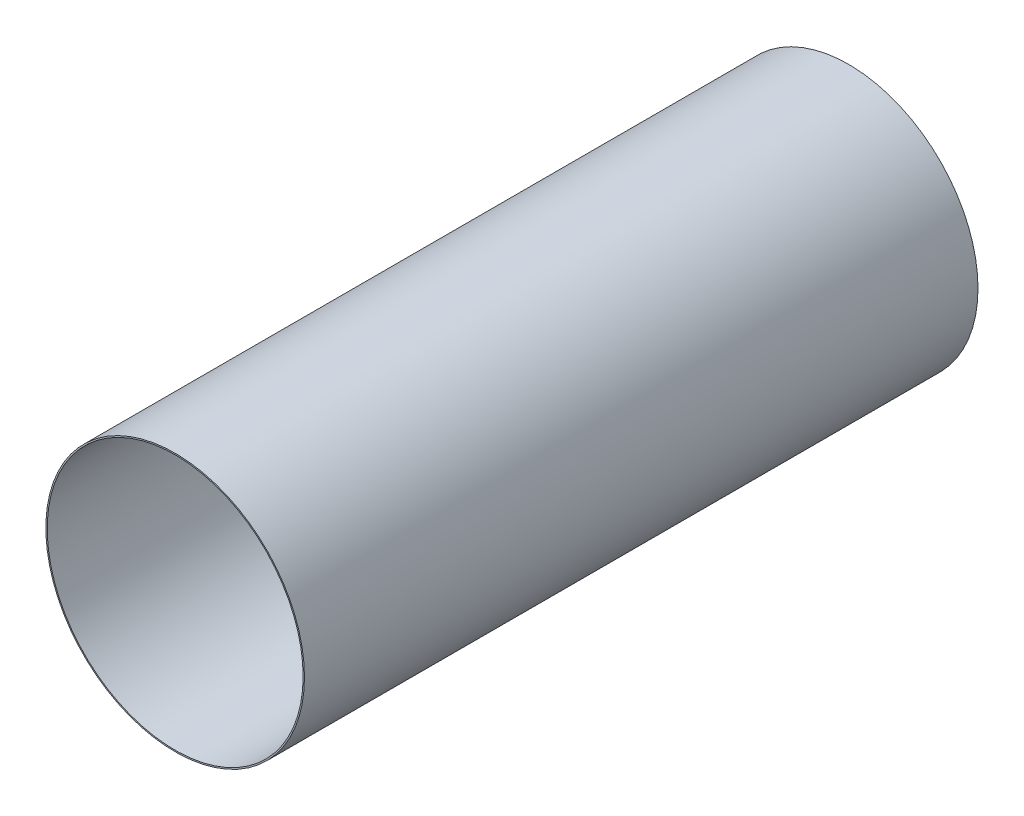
ISO-10303-21;
HEADER;
FILE_DESCRIPTION(('STEP AP214'),'2;1');
FILE_NAME('part.step','',(''),(''),'','','');
FILE_SCHEMA(('AUTOMOTIVE_DESIGN { 1 0 10303 214 1 1 1 1 }'));
ENDSEC;
DATA;
#1=APPLICATION_CONTEXT('core data for automotive mechanical design processes');
#2=APPLICATION_PROTOCOL_DEFINITION('international standard','automotive_design',2000,#1);
#3=PRODUCT_CONTEXT('',#1,'mechanical');
#4=PRODUCT('Part','Part','',(#3));
#5=PRODUCT_RELATED_PRODUCT_CATEGORY('part','',(#4));
#6=PRODUCT_DEFINITION_FORMATION('','',#4);
#7=PRODUCT_DEFINITION_CONTEXT('part definition',#1,'design');
#8=PRODUCT_DEFINITION('design','',#6,#7);
#9=PRODUCT_DEFINITION_SHAPE('','',#8);
#10=(LENGTH_UNIT() NAMED_UNIT(*) SI_UNIT(.MILLI.,.METRE.));
#11=(NAMED_UNIT(*) PLANE_ANGLE_UNIT() SI_UNIT($,.RADIAN.));
#12=(NAMED_UNIT(*) SI_UNIT($,.STERADIAN.) SOLID_ANGLE_UNIT());
#13=UNCERTAINTY_MEASURE_WITH_UNIT(LENGTH_MEASURE(1.E-05),#10,'distance_accuracy_value','');
#14=(GEOMETRIC_REPRESENTATION_CONTEXT(3) GLOBAL_UNCERTAINTY_ASSIGNED_CONTEXT((#13)) GLOBAL_UNIT_ASSIGNED_CONTEXT((#10,
#11,#12)) REPRESENTATION_CONTEXT('',''));
#15=CARTESIAN_POINT('',(0.,0.,0.));
#16=DIRECTION('',(0.,0.,1.));
#17=DIRECTION('',(1.,0.,0.));
#18=AXIS2_PLACEMENT_3D('',#15,#16,#17);
#19=CARTESIAN_POINT('',(0.,0.,-100.));
#20=DIRECTION('',(0.,0.,1.));
#21=DIRECTION('',(1.,0.,0.));
#22=AXIS2_PLACEMENT_3D('',#19,#20,#21);
#23=CYLINDRICAL_SURFACE('',#22,19.2);
#24=CARTESIAN_POINT('',(0.,0.,-100.));
#25=DIRECTION('',(0.,0.,1.));
#26=DIRECTION('',(1.,0.,0.));
#27=AXIS2_PLACEMENT_3D('',#24,#25,#26);
#28=CIRCLE('',#27,19.2);
#29=CARTESIAN_POINT('',(19.2,0.,-100.));
#30=VERTEX_POINT('',#29);
#31=EDGE_CURVE('E10',#30,#30,#28,.T.);
#32=ORIENTED_EDGE('',*,*,#31,.T.);
#33=EDGE_LOOP('',(#32));
#34=FACE_BOUND('',#33,.T.);
#35=CARTESIAN_POINT('',(0.,0.,0.));
#36=DIRECTION('',(0.,0.,1.));
#37=DIRECTION('',(1.,0.,0.));
#38=AXIS2_PLACEMENT_3D('',#35,#36,#37);
#39=CIRCLE('',#38,19.2);
#40=CARTESIAN_POINT('',(19.2,0.,0.));
#41=VERTEX_POINT('',#40);
#42=EDGE_CURVE('E40',#41,#41,#39,.T.);
#43=ORIENTED_EDGE('',*,*,#42,.F.);
#44=EDGE_LOOP('',(#43));
#45=FACE_BOUND('',#44,.T.);
#46=ADVANCED_FACE('F37',(#34,#45),#23,.T.);
#47=CARTESIAN_POINT('',(0.,0.,-100.));
#48=DIRECTION('',(0.,0.,1.));
#49=DIRECTION('',(1.,0.,0.));
#50=AXIS2_PLACEMENT_3D('',#47,#48,#49);
#51=PLANE('',#50);
#52=CARTESIAN_POINT('',(0.,0.,-100.));
#53=DIRECTION('',(0.,0.,1.));
#54=DIRECTION('',(1.,0.,0.));
#55=AXIS2_PLACEMENT_3D('',#52,#53,#54);
#56=CIRCLE('',#55,19.);
#57=CARTESIAN_POINT('',(19.,0.,-100.));
#58=VERTEX_POINT('',#57);
#59=EDGE_CURVE('E47',#58,#58,#56,.T.);
#60=ORIENTED_EDGE('',*,*,#59,.T.);
#61=EDGE_LOOP('',(#60));
#62=FACE_BOUND('',#61,.T.);
#63=ORIENTED_EDGE('',*,*,#31,.F.);
#64=EDGE_LOOP('',(#63));
#65=FACE_BOUND('',#64,.T.);
#66=ADVANCED_FACE('F55',(#62,#65),#51,.F.);
#67=CARTESIAN_POINT('',(0.,0.,0.));
#68=DIRECTION('',(0.,0.,1.));
#69=DIRECTION('',(1.,0.,0.));
#70=AXIS2_PLACEMENT_3D('',#67,#68,#69);
#71=PLANE('',#70);
#72=CARTESIAN_POINT('',(0.,0.,0.));
#73=DIRECTION('',(0.,0.,1.));
#74=DIRECTION('',(1.,0.,0.));
#75=AXIS2_PLACEMENT_3D('',#72,#73,#74);
#76=CIRCLE('',#75,19.);
#77=CARTESIAN_POINT('',(19.,0.,0.));
#78=VERTEX_POINT('',#77);
#79=EDGE_CURVE('E49',#78,#78,#76,.T.);
#80=ORIENTED_EDGE('',*,*,#79,.F.);
#81=EDGE_LOOP('',(#80));
#82=FACE_BOUND('',#81,.T.);
#83=ORIENTED_EDGE('',*,*,#42,.T.);
#84=EDGE_LOOP('',(#83));
#85=FACE_BOUND('',#84,.T.);
#86=ADVANCED_FACE('F61',(#82,#85),#71,.T.);
#87=CARTESIAN_POINT('',(0.,0.,-100.));
#88=DIRECTION('',(0.,0.,1.));
#89=DIRECTION('',(1.,0.,0.));
#90=AXIS2_PLACEMENT_3D('',#87,#88,#89);
#91=CYLINDRICAL_SURFACE('',#90,19.);
#92=ORIENTED_EDGE('',*,*,#59,.F.);
#93=EDGE_LOOP('',(#92));
#94=FACE_BOUND('',#93,.T.);
#95=ORIENTED_EDGE('',*,*,#79,.T.);
#96=EDGE_LOOP('',(#95));
#97=FACE_BOUND('',#96,.T.);
#98=ADVANCED_FACE('F58',(#94,#97),#91,.F.);
#99=CLOSED_SHELL('',(#46,#66,#86,#98));
#100=MANIFOLD_SOLID_BREP('B2',#99);
#101=ADVANCED_BREP_SHAPE_REPRESENTATION('',(#18,#100),#14);
#102=SHAPE_DEFINITION_REPRESENTATION(#9,#101);
ENDSEC;
END-ISO-10303-21;
